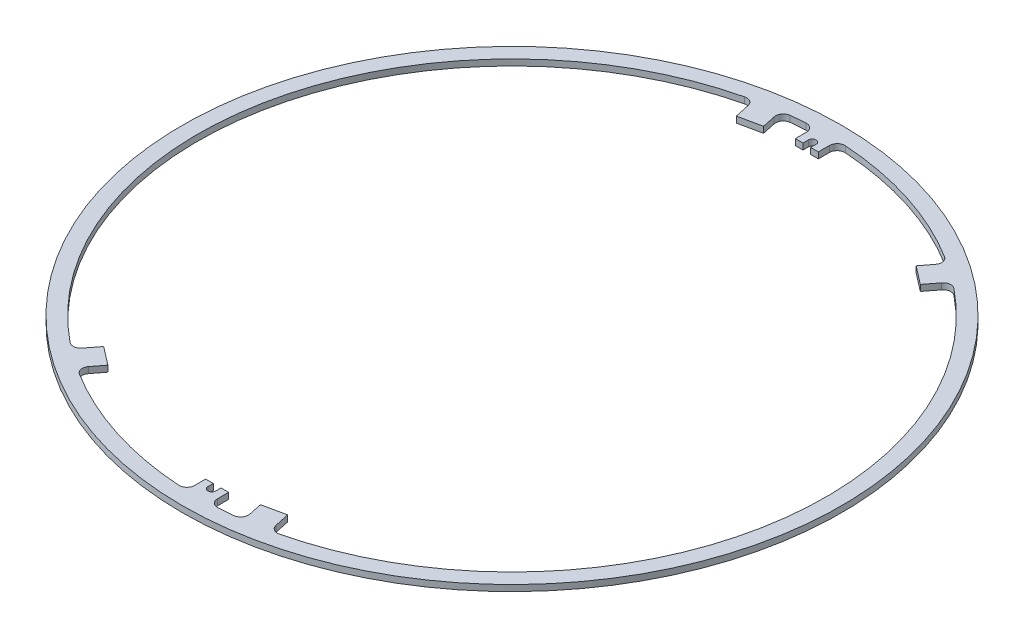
from build123d import *

# Parameters (mm, degrees)
SKETCH_1_R          = 43
SKETCH_1_R_2        = 41
EXTRUDE_1_DEPTH     = 0.8
EXTRUDE_START       = -0.8
EXTRUDE_2_DEPTH     = 0.8
FILLET_1_R          = 1
FILLET_2_R          = 1
CUT_EXTRUDE_1_DEPTH = 61.816445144
EXTRUDE_3_DEPTH     = 0.8
FILLET_3_R          = 1
EXTRUDE_4_DEPTH     = 0.8
FILLET_4_R          = 1


with BuildPart() as part:
    # Sketch 1 → Extrude 1 (new body)
    with BuildSketch(Plane(origin=(0, 0, 0), x_dir=(1, 0, 0), z_dir=(0, 1, 0))):
        with Locations(Location((0, 0, 0), (0, 0, 270))):
            Circle(SKETCH_1_R)
        with Locations(Location((0, 0, 0), (0, 0, 270))):
            Circle(SKETCH_1_R_2, mode=Mode.SUBTRACT)
    extrude(amount=EXTRUDE_1_DEPTH)

    # Sketch 2 → Extrude 2 (add)
    with BuildSketch(Plane(origin=(0, 0.8, 0), x_dir=(1, 0, 0), z_dir=(0, 1, 0)).offset(EXTRUDE_START)):
        with BuildLine():
            Line((-1.5, -38.472551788), (-1.5, -40.972551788))
            ThreePointArc((-1.5, -40.972551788), (0, -41), (1.5, -40.972551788))
            Line((1.5, -40.972551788), (1.5, -38.472551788))
            Line((1.5, -38.472551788), (-1.5, -38.472551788))
        make_face()
        with BuildLine():
            ThreePointArc((1.5, 40.972551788), (0, 41), (-1.5, 40.972551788))
            Line((-1.5, 40.972551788), (-1.5, 38.472551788))
            Line((-1.5, 38.472551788), (1.5, 38.472551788))
            Line((1.5, 38.472551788), (1.5, 40.972551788))
        make_face()
    extrude(amount=EXTRUDE_2_DEPTH)

    # Fillet 1
    fillet_1_edges = [part.edges().sort_by_distance(p)[0] for p in [
        (-1.5, 0.4, -40.972551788),
        (1.5, 0.4, -40.972551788),
    ]]
    fillet(fillet_1_edges, radius=FILLET_1_R)

    # Fillet 2
    fillet_2_edges = [part.edges().sort_by_distance(p)[0] for p in [
        (-1.5, 0.4, 40.972551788),
        (1.5, 0.4, 40.972551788),
    ]]
    fillet(fillet_2_edges, radius=FILLET_2_R)

    # Sketch 3 → Cut-Extrude 1 (cut, through all)
    with BuildSketch(Plane.XZ):
        with BuildLine():
            Line((-0.5, 39.172551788), (-0.5, 36.172551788))
            Line((-0.5, 36.172551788), (0.5, 36.172551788))
            Line((0.5, 36.172551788), (0.5, 39.172551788))
            ThreePointArc((0.5, 39.172551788), (0, 39.672551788), (-0.5, 39.172551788))
        make_face()
        with BuildLine():
            Line((0.5, -36.172551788), (0.5, -39.172551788))
            ThreePointArc((0.5, -39.172551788), (0, -39.672551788), (-0.5, -39.172551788))
            Line((-0.5, -39.172551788), (-0.5, -36.172551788))
            Line((-0.5, -36.172551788), (0.5, -36.172551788))
        make_face()
    extrude(amount=-CUT_EXTRUDE_1_DEPTH, mode=Mode.SUBTRACT)

    # Sketch 4 → Extrude 3 (add)
    with BuildSketch(Plane(origin=(0, 0.8, 0), x_dir=(1, 0, 0), z_dir=(0, 1, 0)).offset(EXTRUDE_START)):
        with BuildLine():
            Line((-24.959218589, -32.527486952), (-23.132934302, -30.147426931))
            Line((-23.132934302, -30.147426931), (-20.752874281, -31.973711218))
            Line((-20.752874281, -31.973711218), (-22.512253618, -34.26657901))
            ThreePointArc((-22.512253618, -34.26657901), (-23.751658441, -33.419436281), (-24.959218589, -32.527486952))
        make_face()
        with BuildLine():
            Line((24.959218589, 32.527486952), (23.132934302, 30.147426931))
            Line((23.132934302, 30.147426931), (20.752874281, 31.973711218))
            Line((20.752874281, 31.973711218), (22.512253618, 34.26657901))
            ThreePointArc((22.512253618, 34.26657901), (23.751658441, 33.419436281), (24.959218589, 32.527486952))
        make_face()
    extrude(amount=EXTRUDE_3_DEPTH)

    # Fillet 3
    fillet_3_edges = [part.edges().sort_by_distance(p)[0] for p in [
        (-22.512253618, 0.4, 34.26657901),
        (-24.959218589, 0.4, 32.527486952),
        (22.512253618, 0.4, -34.26657901),
        (24.959218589, 0.4, -32.527486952),
    ]]
    fillet(fillet_3_edges, radius=FILLET_3_R)

    # Sketch 5 → Extrude 4 (add)
    with BuildSketch(Plane.XZ):
        with BuildLine():
            Line((8.524379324, 40.10405163), (7.900644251, 37.169608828))
            Line((7.900644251, 37.169608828), (4.966201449, 37.7933439))
            Line((4.966201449, 37.7933439), (5.56708632, 40.620284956))
            ThreePointArc((5.56708632, 40.620284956), (7.050459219, 40.389243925), (8.524379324, 40.10405163))
        make_face()
        with BuildLine():
            Line((-4.966201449, -37.7933439), (-5.56708632, -40.620284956))
            ThreePointArc((-5.56708632, -40.620284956), (-7.050459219, -40.389243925), (-8.524379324, -40.10405163))
            Line((-8.524379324, -40.10405163), (-7.900644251, -37.169608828))
            Line((-7.900644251, -37.169608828), (-4.966201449, -37.7933439))
        make_face()
    extrude(amount=-EXTRUDE_4_DEPTH)

    # Fillet 4
    fillet_4_edges = [part.edges().sort_by_distance(p)[0] for p in [
        (8.524379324, 0.4, 40.10405163),
        (5.56708632, 0.4, 40.620284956),
        (-8.524379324, 0.4, -40.10405163),
        (-5.56708632, 0.4, -40.620284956),
    ]]
    fillet(fillet_4_edges, radius=FILLET_4_R)


solid = part.part
